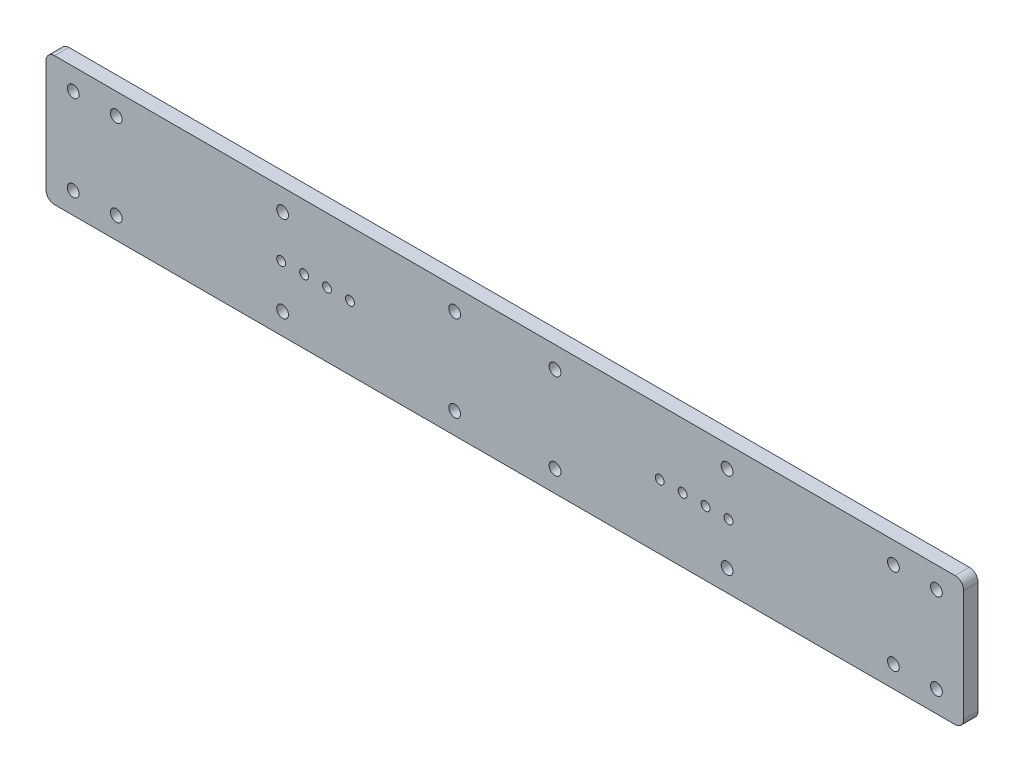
ISO-10303-21;
HEADER;
FILE_DESCRIPTION(('STEP AP214'),'2;1');
FILE_NAME('part.step','',(''),(''),'','','');
FILE_SCHEMA(('AUTOMOTIVE_DESIGN { 1 0 10303 214 1 1 1 1 }'));
ENDSEC;
DATA;
#1=APPLICATION_CONTEXT('core data for automotive mechanical design processes');
#2=APPLICATION_PROTOCOL_DEFINITION('international standard','automotive_design',2000,#1);
#3=PRODUCT_CONTEXT('',#1,'mechanical');
#4=PRODUCT('Part','Part','',(#3));
#5=PRODUCT_RELATED_PRODUCT_CATEGORY('part','',(#4));
#6=PRODUCT_DEFINITION_FORMATION('','',#4);
#7=PRODUCT_DEFINITION_CONTEXT('part definition',#1,'design');
#8=PRODUCT_DEFINITION('design','',#6,#7);
#9=PRODUCT_DEFINITION_SHAPE('','',#8);
#10=(LENGTH_UNIT() NAMED_UNIT(*) SI_UNIT(.MILLI.,.METRE.));
#11=(NAMED_UNIT(*) PLANE_ANGLE_UNIT() SI_UNIT($,.RADIAN.));
#12=(NAMED_UNIT(*) SI_UNIT($,.STERADIAN.) SOLID_ANGLE_UNIT());
#13=UNCERTAINTY_MEASURE_WITH_UNIT(LENGTH_MEASURE(1.E-05),#10,'distance_accuracy_value','');
#14=(GEOMETRIC_REPRESENTATION_CONTEXT(3) GLOBAL_UNCERTAINTY_ASSIGNED_CONTEXT((#13)) GLOBAL_UNIT_ASSIGNED_CONTEXT((#10,
#11,#12)) REPRESENTATION_CONTEXT('',''));
#15=CARTESIAN_POINT('',(0.,0.,0.));
#16=DIRECTION('',(0.,0.,1.));
#17=DIRECTION('',(1.,0.,0.));
#18=AXIS2_PLACEMENT_3D('',#15,#16,#17);
#19=CARTESIAN_POINT('',(0.,0.,5.));
#20=DIRECTION('',(0.,0.,-1.));
#21=DIRECTION('',(-1.,0.,0.));
#22=AXIS2_PLACEMENT_3D('',#19,#20,#21);
#23=PLANE('',#22);
#24=CARTESIAN_POINT('',(-54.,-1.20299930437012E-13,5.));
#25=DIRECTION('',(0.,0.,1.));
#26=DIRECTION('',(1.,0.,0.));
#27=AXIS2_PLACEMENT_3D('',#24,#25,#26);
#28=CIRCLE('',#27,1.54999999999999);
#29=CARTESIAN_POINT('',(-52.45,-1.20299930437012E-13,5.));
#30=VERTEX_POINT('',#29);
#31=EDGE_CURVE('E310',#30,#30,#28,.T.);
#32=ORIENTED_EDGE('',*,*,#31,.F.);
#33=EDGE_LOOP('',(#32));
#34=FACE_BOUND('',#33,.T.);
#35=CARTESIAN_POINT('',(54.,-1.20299930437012E-13,5.));
#36=DIRECTION('',(0.,0.,1.));
#37=DIRECTION('',(-1.,0.,0.));
#38=AXIS2_PLACEMENT_3D('',#35,#36,#37);
#39=CIRCLE('',#38,1.54999999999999);
#40=CARTESIAN_POINT('',(52.45,-1.20299930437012E-13,5.));
#41=VERTEX_POINT('',#40);
#42=EDGE_CURVE('E315',#41,#41,#39,.T.);
#43=ORIENTED_EDGE('',*,*,#42,.F.);
#44=EDGE_LOOP('',(#43));
#45=FACE_BOUND('',#44,.T.);
#46=CARTESIAN_POINT('',(62.,-1.2127964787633E-13,5.));
#47=DIRECTION('',(0.,0.,1.));
#48=DIRECTION('',(-1.,0.,0.));
#49=AXIS2_PLACEMENT_3D('',#46,#47,#48);
#50=CIRCLE('',#49,1.54999999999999);
#51=CARTESIAN_POINT('',(60.45,-1.2127964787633E-13,5.));
#52=VERTEX_POINT('',#51);
#53=EDGE_CURVE('E318',#52,#52,#50,.T.);
#54=ORIENTED_EDGE('',*,*,#53,.F.);
#55=EDGE_LOOP('',(#54));
#56=FACE_BOUND('',#55,.T.);
#57=CARTESIAN_POINT('',(-62.,-1.2127964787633E-13,5.));
#58=DIRECTION('',(0.,0.,1.));
#59=DIRECTION('',(1.,0.,0.));
#60=AXIS2_PLACEMENT_3D('',#57,#58,#59);
#61=CIRCLE('',#60,1.54999999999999);
#62=CARTESIAN_POINT('',(-60.45,-1.2127964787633E-13,5.));
#63=VERTEX_POINT('',#62);
#64=EDGE_CURVE('E321',#63,#63,#61,.T.);
#65=ORIENTED_EDGE('',*,*,#64,.F.);
#66=EDGE_LOOP('',(#65));
#67=FACE_BOUND('',#66,.T.);
#68=CARTESIAN_POINT('',(78.,0.,5.));
#69=DIRECTION('',(0.,0.,1.));
#70=DIRECTION('',(-1.,0.,0.));
#71=AXIS2_PLACEMENT_3D('',#68,#69,#70);
#72=CIRCLE('',#71,1.54999999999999);
#73=CARTESIAN_POINT('',(76.45,0.,5.));
#74=VERTEX_POINT('',#73);
#75=EDGE_CURVE('E306',#74,#74,#72,.T.);
#76=ORIENTED_EDGE('',*,*,#75,.F.);
#77=EDGE_LOOP('',(#76));
#78=FACE_BOUND('',#77,.T.);
#79=CARTESIAN_POINT('',(70.,0.,5.));
#80=DIRECTION('',(0.,0.,1.));
#81=DIRECTION('',(-1.,0.,0.));
#82=AXIS2_PLACEMENT_3D('',#79,#80,#81);
#83=CIRCLE('',#82,1.54999999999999);
#84=CARTESIAN_POINT('',(68.45,0.,5.));
#85=VERTEX_POINT('',#84);
#86=EDGE_CURVE('E309',#85,#85,#83,.T.);
#87=ORIENTED_EDGE('',*,*,#86,.F.);
#88=EDGE_LOOP('',(#87));
#89=FACE_BOUND('',#88,.T.);
#90=CARTESIAN_POINT('',(-78.,0.,5.));
#91=DIRECTION('',(0.,0.,1.));
#92=DIRECTION('',(1.,0.,0.));
#93=AXIS2_PLACEMENT_3D('',#90,#91,#92);
#94=CIRCLE('',#93,1.54999999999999);
#95=CARTESIAN_POINT('',(-76.45,0.,5.));
#96=VERTEX_POINT('',#95);
#97=EDGE_CURVE('E150',#96,#96,#94,.T.);
#98=ORIENTED_EDGE('',*,*,#97,.F.);
#99=EDGE_LOOP('',(#98));
#100=FACE_BOUND('',#99,.T.);
#101=CARTESIAN_POINT('',(-70.,0.,5.));
#102=DIRECTION('',(0.,0.,1.));
#103=DIRECTION('',(1.,0.,0.));
#104=AXIS2_PLACEMENT_3D('',#101,#102,#103);
#105=CIRCLE('',#104,1.54999999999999);
#106=CARTESIAN_POINT('',(-68.45,0.,5.));
#107=VERTEX_POINT('',#106);
#108=EDGE_CURVE('E145',#107,#107,#105,.T.);
#109=ORIENTED_EDGE('',*,*,#108,.F.);
#110=EDGE_LOOP('',(#109));
#111=FACE_BOUND('',#110,.T.);
#112=DIRECTION('',(0.,1.,0.));
#113=VECTOR('',#112,1.);
#114=CARTESIAN_POINT('',(160.,-22.5,5.));
#115=LINE('',#114,#113);
#116=CARTESIAN_POINT('',(160.,-19.5,5.));
#117=VERTEX_POINT('',#116);
#118=CARTESIAN_POINT('',(160.,19.5,5.));
#119=VERTEX_POINT('',#118);
#120=EDGE_CURVE('E140',#117,#119,#115,.T.);
#121=ORIENTED_EDGE('',*,*,#120,.T.);
#122=CARTESIAN_POINT('',(157.,19.5,5.));
#123=DIRECTION('',(0.,0.,-1.));
#124=DIRECTION('',(-1.,0.,0.));
#125=AXIS2_PLACEMENT_3D('',#122,#123,#124);
#126=CIRCLE('',#125,3.);
#127=CARTESIAN_POINT('',(157.,22.5,5.));
#128=VERTEX_POINT('',#127);
#129=EDGE_CURVE('E181',#119,#128,#126,.F.);
#130=ORIENTED_EDGE('',*,*,#129,.T.);
#131=DIRECTION('',(-1.,0.,0.));
#132=VECTOR('',#131,1.);
#133=CARTESIAN_POINT('',(-160.,22.5,5.));
#134=LINE('',#133,#132);
#135=CARTESIAN_POINT('',(-157.,22.5,5.));
#136=VERTEX_POINT('',#135);
#137=EDGE_CURVE('E121',#128,#136,#134,.T.);
#138=ORIENTED_EDGE('',*,*,#137,.T.);
#139=CARTESIAN_POINT('',(-157.,19.5,5.));
#140=DIRECTION('',(0.,0.,-1.));
#141=DIRECTION('',(-1.,0.,0.));
#142=AXIS2_PLACEMENT_3D('',#139,#140,#141);
#143=CIRCLE('',#142,3.);
#144=CARTESIAN_POINT('',(-160.,19.5,5.));
#145=VERTEX_POINT('',#144);
#146=EDGE_CURVE('E177',#136,#145,#143,.F.);
#147=ORIENTED_EDGE('',*,*,#146,.T.);
#148=DIRECTION('',(0.,-1.,0.));
#149=VECTOR('',#148,1.);
#150=CARTESIAN_POINT('',(-160.,-22.5,5.));
#151=LINE('',#150,#149);
#152=CARTESIAN_POINT('',(-160.,-19.5,5.));
#153=VERTEX_POINT('',#152);
#154=EDGE_CURVE('E190',#145,#153,#151,.T.);
#155=ORIENTED_EDGE('',*,*,#154,.T.);
#156=CARTESIAN_POINT('',(-157.,-19.5,5.));
#157=DIRECTION('',(0.,0.,-1.));
#158=DIRECTION('',(-1.,0.,0.));
#159=AXIS2_PLACEMENT_3D('',#156,#157,#158);
#160=CIRCLE('',#159,3.);
#161=CARTESIAN_POINT('',(-157.,-22.5,5.));
#162=VERTEX_POINT('',#161);
#163=EDGE_CURVE('E56',#153,#162,#160,.F.);
#164=ORIENTED_EDGE('',*,*,#163,.T.);
#165=DIRECTION('',(1.,0.,0.));
#166=VECTOR('',#165,1.);
#167=CARTESIAN_POINT('',(-160.,-22.5,5.));
#168=LINE('',#167,#166);
#169=CARTESIAN_POINT('',(157.,-22.5,5.));
#170=VERTEX_POINT('',#169);
#171=EDGE_CURVE('E168',#162,#170,#168,.T.);
#172=ORIENTED_EDGE('',*,*,#171,.T.);
#173=CARTESIAN_POINT('',(157.,-19.5,5.));
#174=DIRECTION('',(0.,0.,-1.));
#175=DIRECTION('',(-1.,0.,0.));
#176=AXIS2_PLACEMENT_3D('',#173,#174,#175);
#177=CIRCLE('',#176,3.);
#178=EDGE_CURVE('E179',#170,#117,#177,.F.);
#179=ORIENTED_EDGE('',*,*,#178,.T.);
#180=EDGE_LOOP('',(#121,#130,#138,#147,#155,#164,#172,#179));
#181=FACE_BOUND('',#180,.T.);
#182=CARTESIAN_POINT('',(-17.5,15.,5.));
#183=DIRECTION('',(0.,0.,1.));
#184=DIRECTION('',(1.,0.,0.));
#185=AXIS2_PLACEMENT_3D('',#182,#183,#184);
#186=CIRCLE('',#185,2.04999999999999);
#187=CARTESIAN_POINT('',(-15.45,15.,5.));
#188=VERTEX_POINT('',#187);
#189=EDGE_CURVE('E135',#188,#188,#186,.T.);
#190=ORIENTED_EDGE('',*,*,#189,.F.);
#191=EDGE_LOOP('',(#190));
#192=FACE_BOUND('',#191,.T.);
#193=CARTESIAN_POINT('',(-150.5,15.,5.));
#194=DIRECTION('',(0.,0.,1.));
#195=DIRECTION('',(1.,0.,0.));
#196=AXIS2_PLACEMENT_3D('',#193,#194,#195);
#197=CIRCLE('',#196,2.04999999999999);
#198=CARTESIAN_POINT('',(-148.45,15.,5.));
#199=VERTEX_POINT('',#198);
#200=EDGE_CURVE('E213',#199,#199,#197,.T.);
#201=ORIENTED_EDGE('',*,*,#200,.F.);
#202=EDGE_LOOP('',(#201));
#203=FACE_BOUND('',#202,.T.);
#204=CARTESIAN_POINT('',(17.5,15.,5.));
#205=DIRECTION('',(0.,0.,1.));
#206=DIRECTION('',(1.,0.,0.));
#207=AXIS2_PLACEMENT_3D('',#204,#205,#206);
#208=CIRCLE('',#207,2.04999999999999);
#209=CARTESIAN_POINT('',(19.55,15.,5.));
#210=VERTEX_POINT('',#209);
#211=EDGE_CURVE('E219',#210,#210,#208,.T.);
#212=ORIENTED_EDGE('',*,*,#211,.F.);
#213=EDGE_LOOP('',(#212));
#214=FACE_BOUND('',#213,.T.);
#215=CARTESIAN_POINT('',(17.5000000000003,-15.,5.));
#216=DIRECTION('',(0.,0.,1.));
#217=DIRECTION('',(1.,0.,0.));
#218=AXIS2_PLACEMENT_3D('',#215,#216,#217);
#219=CIRCLE('',#218,2.04999999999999);
#220=CARTESIAN_POINT('',(19.5500000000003,-15.,5.));
#221=VERTEX_POINT('',#220);
#222=EDGE_CURVE('E225',#221,#221,#219,.T.);
#223=ORIENTED_EDGE('',*,*,#222,.F.);
#224=EDGE_LOOP('',(#223));
#225=FACE_BOUND('',#224,.T.);
#226=CARTESIAN_POINT('',(-17.4999999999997,-15.,5.));
#227=DIRECTION('',(0.,0.,1.));
#228=DIRECTION('',(1.,0.,0.));
#229=AXIS2_PLACEMENT_3D('',#226,#227,#228);
#230=CIRCLE('',#229,2.04999999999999);
#231=CARTESIAN_POINT('',(-15.4499999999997,-15.,5.));
#232=VERTEX_POINT('',#231);
#233=EDGE_CURVE('E231',#232,#232,#230,.T.);
#234=ORIENTED_EDGE('',*,*,#233,.F.);
#235=EDGE_LOOP('',(#234));
#236=FACE_BOUND('',#235,.T.);
#237=CARTESIAN_POINT('',(150.5,15.,5.));
#238=DIRECTION('',(0.,0.,1.));
#239=DIRECTION('',(-1.,0.,0.));
#240=AXIS2_PLACEMENT_3D('',#237,#238,#239);
#241=CIRCLE('',#240,2.04999999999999);
#242=CARTESIAN_POINT('',(148.45,15.,5.));
#243=VERTEX_POINT('',#242);
#244=EDGE_CURVE('E237',#243,#243,#241,.T.);
#245=ORIENTED_EDGE('',*,*,#244,.F.);
#246=EDGE_LOOP('',(#245));
#247=FACE_BOUND('',#246,.T.);
#248=CARTESIAN_POINT('',(-135.5,15.,5.));
#249=DIRECTION('',(0.,0.,1.));
#250=DIRECTION('',(1.,0.,0.));
#251=AXIS2_PLACEMENT_3D('',#248,#249,#250);
#252=CIRCLE('',#251,2.04999999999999);
#253=CARTESIAN_POINT('',(-133.45,15.,5.));
#254=VERTEX_POINT('',#253);
#255=EDGE_CURVE('E243',#254,#254,#252,.T.);
#256=ORIENTED_EDGE('',*,*,#255,.F.);
#257=EDGE_LOOP('',(#256));
#258=FACE_BOUND('',#257,.T.);
#259=CARTESIAN_POINT('',(-135.5,-15.,5.));
#260=DIRECTION('',(0.,0.,1.));
#261=DIRECTION('',(1.,0.,0.));
#262=AXIS2_PLACEMENT_3D('',#259,#260,#261);
#263=CIRCLE('',#262,2.04999999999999);
#264=CARTESIAN_POINT('',(-133.45,-15.,5.));
#265=VERTEX_POINT('',#264);
#266=EDGE_CURVE('E249',#265,#265,#263,.T.);
#267=ORIENTED_EDGE('',*,*,#266,.F.);
#268=EDGE_LOOP('',(#267));
#269=FACE_BOUND('',#268,.T.);
#270=CARTESIAN_POINT('',(-150.5,-15.,5.));
#271=DIRECTION('',(0.,0.,1.));
#272=DIRECTION('',(1.,0.,0.));
#273=AXIS2_PLACEMENT_3D('',#270,#271,#272);
#274=CIRCLE('',#273,2.04999999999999);
#275=CARTESIAN_POINT('',(-148.45,-15.,5.));
#276=VERTEX_POINT('',#275);
#277=EDGE_CURVE('E255',#276,#276,#274,.T.);
#278=ORIENTED_EDGE('',*,*,#277,.F.);
#279=EDGE_LOOP('',(#278));
#280=FACE_BOUND('',#279,.T.);
#281=CARTESIAN_POINT('',(150.5,-15.,5.));
#282=DIRECTION('',(0.,0.,1.));
#283=DIRECTION('',(-1.,0.,0.));
#284=AXIS2_PLACEMENT_3D('',#281,#282,#283);
#285=CIRCLE('',#284,2.04999999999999);
#286=CARTESIAN_POINT('',(148.45,-15.,5.));
#287=VERTEX_POINT('',#286);
#288=EDGE_CURVE('E261',#287,#287,#285,.T.);
#289=ORIENTED_EDGE('',*,*,#288,.F.);
#290=EDGE_LOOP('',(#289));
#291=FACE_BOUND('',#290,.T.);
#292=CARTESIAN_POINT('',(135.5,-15.,5.));
#293=DIRECTION('',(0.,0.,1.));
#294=DIRECTION('',(-1.,0.,0.));
#295=AXIS2_PLACEMENT_3D('',#292,#293,#294);
#296=CIRCLE('',#295,2.04999999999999);
#297=CARTESIAN_POINT('',(133.45,-15.,5.));
#298=VERTEX_POINT('',#297);
#299=EDGE_CURVE('E267',#298,#298,#296,.T.);
#300=ORIENTED_EDGE('',*,*,#299,.F.);
#301=EDGE_LOOP('',(#300));
#302=FACE_BOUND('',#301,.T.);
#303=CARTESIAN_POINT('',(135.5,15.,5.));
#304=DIRECTION('',(0.,0.,1.));
#305=DIRECTION('',(-1.,0.,0.));
#306=AXIS2_PLACEMENT_3D('',#303,#304,#305);
#307=CIRCLE('',#306,2.04999999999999);
#308=CARTESIAN_POINT('',(133.45,15.,5.));
#309=VERTEX_POINT('',#308);
#310=EDGE_CURVE('E273',#309,#309,#307,.T.);
#311=ORIENTED_EDGE('',*,*,#310,.F.);
#312=EDGE_LOOP('',(#311));
#313=FACE_BOUND('',#312,.T.);
#314=CARTESIAN_POINT('',(-77.5,14.9999999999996,5.));
#315=DIRECTION('',(0.,0.,1.));
#316=DIRECTION('',(1.,0.,0.));
#317=AXIS2_PLACEMENT_3D('',#314,#315,#316);
#318=CIRCLE('',#317,2.04999999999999);
#319=CARTESIAN_POINT('',(-75.45,14.9999999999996,5.));
#320=VERTEX_POINT('',#319);
#321=EDGE_CURVE('E279',#320,#320,#318,.T.);
#322=ORIENTED_EDGE('',*,*,#321,.F.);
#323=EDGE_LOOP('',(#322));
#324=FACE_BOUND('',#323,.T.);
#325=CARTESIAN_POINT('',(-77.4999999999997,-15.0000000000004,5.));
#326=DIRECTION('',(0.,0.,1.));
#327=DIRECTION('',(1.,0.,0.));
#328=AXIS2_PLACEMENT_3D('',#325,#326,#327);
#329=CIRCLE('',#328,2.04999999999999);
#330=CARTESIAN_POINT('',(-75.4499999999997,-15.0000000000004,5.));
#331=VERTEX_POINT('',#330);
#332=EDGE_CURVE('E285',#331,#331,#329,.T.);
#333=ORIENTED_EDGE('',*,*,#332,.F.);
#334=EDGE_LOOP('',(#333));
#335=FACE_BOUND('',#334,.T.);
#336=CARTESIAN_POINT('',(77.4999999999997,-15.0000000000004,5.));
#337=DIRECTION('',(0.,0.,1.));
#338=DIRECTION('',(-1.,0.,0.));
#339=AXIS2_PLACEMENT_3D('',#336,#337,#338);
#340=CIRCLE('',#339,2.04999999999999);
#341=CARTESIAN_POINT('',(75.4499999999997,-15.0000000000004,5.));
#342=VERTEX_POINT('',#341);
#343=EDGE_CURVE('E291',#342,#342,#340,.T.);
#344=ORIENTED_EDGE('',*,*,#343,.F.);
#345=EDGE_LOOP('',(#344));
#346=FACE_BOUND('',#345,.T.);
#347=CARTESIAN_POINT('',(77.5,14.9999999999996,5.));
#348=DIRECTION('',(0.,0.,1.));
#349=DIRECTION('',(-1.,0.,0.));
#350=AXIS2_PLACEMENT_3D('',#347,#348,#349);
#351=CIRCLE('',#350,2.04999999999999);
#352=CARTESIAN_POINT('',(75.45,14.9999999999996,5.));
#353=VERTEX_POINT('',#352);
#354=EDGE_CURVE('E297',#353,#353,#351,.T.);
#355=ORIENTED_EDGE('',*,*,#354,.F.);
#356=EDGE_LOOP('',(#355));
#357=FACE_BOUND('',#356,.T.);
#358=ADVANCED_FACE('F34',(#34,#45,#56,#67,#78,#89,#100,#111,#181,#192,#203,#214,#225,#236,#247,
#258,#269,#280,#291,#302,#313,#324,#335,#346,#357),#23,.F.);
#359=CARTESIAN_POINT('',(0.,0.,0.));
#360=DIRECTION('',(0.,0.,-1.));
#361=DIRECTION('',(-1.,0.,0.));
#362=AXIS2_PLACEMENT_3D('',#359,#360,#361);
#363=PLANE('',#362);
#364=CARTESIAN_POINT('',(-54.,-1.20299930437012E-13,0.));
#365=DIRECTION('',(0.,0.,-1.));
#366=DIRECTION('',(-1.,0.,0.));
#367=AXIS2_PLACEMENT_3D('',#364,#365,#366);
#368=CIRCLE('',#367,1.54999999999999);
#369=CARTESIAN_POINT('',(-55.55,-1.20299930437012E-13,0.));
#370=VERTEX_POINT('',#369);
#371=EDGE_CURVE('E165',#370,#370,#368,.T.);
#372=ORIENTED_EDGE('',*,*,#371,.F.);
#373=EDGE_LOOP('',(#372));
#374=FACE_BOUND('',#373,.T.);
#375=CARTESIAN_POINT('',(54.,-1.20299930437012E-13,0.));
#376=DIRECTION('',(0.,0.,-1.));
#377=DIRECTION('',(-1.,0.,0.));
#378=AXIS2_PLACEMENT_3D('',#375,#376,#377);
#379=CIRCLE('',#378,1.54999999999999);
#380=CARTESIAN_POINT('',(52.45,-1.20299930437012E-13,0.));
#381=VERTEX_POINT('',#380);
#382=EDGE_CURVE('E162',#381,#381,#379,.T.);
#383=ORIENTED_EDGE('',*,*,#382,.F.);
#384=EDGE_LOOP('',(#383));
#385=FACE_BOUND('',#384,.T.);
#386=CARTESIAN_POINT('',(62.,-1.2127964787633E-13,0.));
#387=DIRECTION('',(0.,0.,-1.));
#388=DIRECTION('',(-1.,0.,0.));
#389=AXIS2_PLACEMENT_3D('',#386,#387,#388);
#390=CIRCLE('',#389,1.54999999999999);
#391=CARTESIAN_POINT('',(60.45,-1.2127964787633E-13,0.));
#392=VERTEX_POINT('',#391);
#393=EDGE_CURVE('E159',#392,#392,#390,.T.);
#394=ORIENTED_EDGE('',*,*,#393,.F.);
#395=EDGE_LOOP('',(#394));
#396=FACE_BOUND('',#395,.T.);
#397=CARTESIAN_POINT('',(-62.,-1.2127964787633E-13,0.));
#398=DIRECTION('',(0.,0.,-1.));
#399=DIRECTION('',(-1.,0.,0.));
#400=AXIS2_PLACEMENT_3D('',#397,#398,#399);
#401=CIRCLE('',#400,1.54999999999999);
#402=CARTESIAN_POINT('',(-63.55,-1.2127964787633E-13,0.));
#403=VERTEX_POINT('',#402);
#404=EDGE_CURVE('E156',#403,#403,#401,.T.);
#405=ORIENTED_EDGE('',*,*,#404,.F.);
#406=EDGE_LOOP('',(#405));
#407=FACE_BOUND('',#406,.T.);
#408=CARTESIAN_POINT('',(78.,0.,0.));
#409=DIRECTION('',(0.,0.,-1.));
#410=DIRECTION('',(-1.,0.,0.));
#411=AXIS2_PLACEMENT_3D('',#408,#409,#410);
#412=CIRCLE('',#411,1.54999999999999);
#413=CARTESIAN_POINT('',(76.45,0.,0.));
#414=VERTEX_POINT('',#413);
#415=EDGE_CURVE('E153',#414,#414,#412,.T.);
#416=ORIENTED_EDGE('',*,*,#415,.F.);
#417=EDGE_LOOP('',(#416));
#418=FACE_BOUND('',#417,.T.);
#419=CARTESIAN_POINT('',(70.,0.,0.));
#420=DIRECTION('',(0.,0.,-1.));
#421=DIRECTION('',(-1.,0.,0.));
#422=AXIS2_PLACEMENT_3D('',#419,#420,#421);
#423=CIRCLE('',#422,1.54999999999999);
#424=CARTESIAN_POINT('',(68.45,0.,0.));
#425=VERTEX_POINT('',#424);
#426=EDGE_CURVE('E149',#425,#425,#423,.T.);
#427=ORIENTED_EDGE('',*,*,#426,.F.);
#428=EDGE_LOOP('',(#427));
#429=FACE_BOUND('',#428,.T.);
#430=CARTESIAN_POINT('',(-78.,0.,0.));
#431=DIRECTION('',(0.,0.,-1.));
#432=DIRECTION('',(-1.,0.,0.));
#433=AXIS2_PLACEMENT_3D('',#430,#431,#432);
#434=CIRCLE('',#433,1.54999999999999);
#435=CARTESIAN_POINT('',(-79.55,0.,0.));
#436=VERTEX_POINT('',#435);
#437=EDGE_CURVE('E146',#436,#436,#434,.T.);
#438=ORIENTED_EDGE('',*,*,#437,.F.);
#439=EDGE_LOOP('',(#438));
#440=FACE_BOUND('',#439,.T.);
#441=CARTESIAN_POINT('',(-70.,0.,0.));
#442=DIRECTION('',(0.,0.,-1.));
#443=DIRECTION('',(-1.,0.,0.));
#444=AXIS2_PLACEMENT_3D('',#441,#442,#443);
#445=CIRCLE('',#444,1.54999999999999);
#446=CARTESIAN_POINT('',(-71.55,0.,0.));
#447=VERTEX_POINT('',#446);
#448=EDGE_CURVE('E141',#447,#447,#445,.T.);
#449=ORIENTED_EDGE('',*,*,#448,.F.);
#450=EDGE_LOOP('',(#449));
#451=FACE_BOUND('',#450,.T.);
#452=CARTESIAN_POINT('',(77.4999999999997,-15.0000000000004,0.));
#453=DIRECTION('',(0.,0.,1.));
#454=DIRECTION('',(-1.,0.,0.));
#455=AXIS2_PLACEMENT_3D('',#452,#453,#454);
#456=CIRCLE('',#455,2.04999999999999);
#457=CARTESIAN_POINT('',(75.4499999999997,-15.0000000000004,0.));
#458=VERTEX_POINT('',#457);
#459=EDGE_CURVE('E294',#458,#458,#456,.T.);
#460=ORIENTED_EDGE('',*,*,#459,.T.);
#461=EDGE_LOOP('',(#460));
#462=FACE_BOUND('',#461,.T.);
#463=CARTESIAN_POINT('',(-77.5,14.9999999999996,0.));
#464=DIRECTION('',(0.,0.,1.));
#465=DIRECTION('',(1.,0.,0.));
#466=AXIS2_PLACEMENT_3D('',#463,#464,#465);
#467=CIRCLE('',#466,2.04999999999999);
#468=CARTESIAN_POINT('',(-75.45,14.9999999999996,0.));
#469=VERTEX_POINT('',#468);
#470=EDGE_CURVE('E282',#469,#469,#467,.T.);
#471=ORIENTED_EDGE('',*,*,#470,.T.);
#472=EDGE_LOOP('',(#471));
#473=FACE_BOUND('',#472,.T.);
#474=CARTESIAN_POINT('',(135.5,-15.,0.));
#475=DIRECTION('',(0.,0.,1.));
#476=DIRECTION('',(-1.,0.,0.));
#477=AXIS2_PLACEMENT_3D('',#474,#475,#476);
#478=CIRCLE('',#477,2.04999999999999);
#479=CARTESIAN_POINT('',(133.45,-15.,0.));
#480=VERTEX_POINT('',#479);
#481=EDGE_CURVE('E270',#480,#480,#478,.T.);
#482=ORIENTED_EDGE('',*,*,#481,.T.);
#483=EDGE_LOOP('',(#482));
#484=FACE_BOUND('',#483,.T.);
#485=CARTESIAN_POINT('',(-150.5,-15.,0.));
#486=DIRECTION('',(0.,0.,1.));
#487=DIRECTION('',(1.,0.,0.));
#488=AXIS2_PLACEMENT_3D('',#485,#486,#487);
#489=CIRCLE('',#488,2.04999999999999);
#490=CARTESIAN_POINT('',(-148.45,-15.,0.));
#491=VERTEX_POINT('',#490);
#492=EDGE_CURVE('E258',#491,#491,#489,.T.);
#493=ORIENTED_EDGE('',*,*,#492,.T.);
#494=EDGE_LOOP('',(#493));
#495=FACE_BOUND('',#494,.T.);
#496=CARTESIAN_POINT('',(-135.5,15.,0.));
#497=DIRECTION('',(0.,0.,1.));
#498=DIRECTION('',(1.,0.,0.));
#499=AXIS2_PLACEMENT_3D('',#496,#497,#498);
#500=CIRCLE('',#499,2.04999999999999);
#501=CARTESIAN_POINT('',(-133.45,15.,0.));
#502=VERTEX_POINT('',#501);
#503=EDGE_CURVE('E246',#502,#502,#500,.T.);
#504=ORIENTED_EDGE('',*,*,#503,.T.);
#505=EDGE_LOOP('',(#504));
#506=FACE_BOUND('',#505,.T.);
#507=CARTESIAN_POINT('',(-17.4999999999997,-15.,0.));
#508=DIRECTION('',(0.,0.,1.));
#509=DIRECTION('',(1.,0.,0.));
#510=AXIS2_PLACEMENT_3D('',#507,#508,#509);
#511=CIRCLE('',#510,2.04999999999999);
#512=CARTESIAN_POINT('',(-15.4499999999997,-15.,0.));
#513=VERTEX_POINT('',#512);
#514=EDGE_CURVE('E234',#513,#513,#511,.T.);
#515=ORIENTED_EDGE('',*,*,#514,.T.);
#516=EDGE_LOOP('',(#515));
#517=FACE_BOUND('',#516,.T.);
#518=CARTESIAN_POINT('',(17.5,15.,0.));
#519=DIRECTION('',(0.,0.,1.));
#520=DIRECTION('',(1.,0.,0.));
#521=AXIS2_PLACEMENT_3D('',#518,#519,#520);
#522=CIRCLE('',#521,2.04999999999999);
#523=CARTESIAN_POINT('',(19.55,15.,0.));
#524=VERTEX_POINT('',#523);
#525=EDGE_CURVE('E222',#524,#524,#522,.T.);
#526=ORIENTED_EDGE('',*,*,#525,.T.);
#527=EDGE_LOOP('',(#526));
#528=FACE_BOUND('',#527,.T.);
#529=CARTESIAN_POINT('',(-17.5,15.,0.));
#530=DIRECTION('',(0.,0.,1.));
#531=DIRECTION('',(1.,0.,0.));
#532=AXIS2_PLACEMENT_3D('',#529,#530,#531);
#533=CIRCLE('',#532,2.04999999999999);
#534=CARTESIAN_POINT('',(-15.45,15.,0.));
#535=VERTEX_POINT('',#534);
#536=EDGE_CURVE('E210',#535,#535,#533,.T.);
#537=ORIENTED_EDGE('',*,*,#536,.T.);
#538=EDGE_LOOP('',(#537));
#539=FACE_BOUND('',#538,.T.);
#540=DIRECTION('',(-1.,0.,0.));
#541=VECTOR('',#540,1.);
#542=CARTESIAN_POINT('',(-160.,22.5,0.));
#543=LINE('',#542,#541);
#544=CARTESIAN_POINT('',(157.,22.5,0.));
#545=VERTEX_POINT('',#544);
#546=CARTESIAN_POINT('',(-157.,22.5,0.));
#547=VERTEX_POINT('',#546);
#548=EDGE_CURVE('E118',#545,#547,#543,.T.);
#549=ORIENTED_EDGE('',*,*,#548,.F.);
#550=CARTESIAN_POINT('',(157.,19.5,0.));
#551=DIRECTION('',(0.,0.,-1.));
#552=DIRECTION('',(-1.,0.,0.));
#553=AXIS2_PLACEMENT_3D('',#550,#551,#552);
#554=CIRCLE('',#553,3.);
#555=CARTESIAN_POINT('',(160.,19.5,0.));
#556=VERTEX_POINT('',#555);
#557=EDGE_CURVE('E101',#545,#556,#554,.T.);
#558=ORIENTED_EDGE('',*,*,#557,.T.);
#559=DIRECTION('',(0.,1.,0.));
#560=VECTOR('',#559,1.);
#561=CARTESIAN_POINT('',(160.,-22.5,0.));
#562=LINE('',#561,#560);
#563=CARTESIAN_POINT('',(160.,-19.5,0.));
#564=VERTEX_POINT('',#563);
#565=EDGE_CURVE('E130',#564,#556,#562,.T.);
#566=ORIENTED_EDGE('',*,*,#565,.F.);
#567=CARTESIAN_POINT('',(157.,-19.5,0.));
#568=DIRECTION('',(0.,0.,-1.));
#569=DIRECTION('',(-1.,0.,0.));
#570=AXIS2_PLACEMENT_3D('',#567,#568,#569);
#571=CIRCLE('',#570,3.);
#572=CARTESIAN_POINT('',(157.,-22.5,0.));
#573=VERTEX_POINT('',#572);
#574=EDGE_CURVE('E112',#564,#573,#571,.T.);
#575=ORIENTED_EDGE('',*,*,#574,.T.);
#576=DIRECTION('',(1.,0.,0.));
#577=VECTOR('',#576,1.);
#578=CARTESIAN_POINT('',(-160.,-22.5,0.));
#579=LINE('',#578,#577);
#580=CARTESIAN_POINT('',(-157.,-22.5,0.));
#581=VERTEX_POINT('',#580);
#582=EDGE_CURVE('E133',#581,#573,#579,.T.);
#583=ORIENTED_EDGE('',*,*,#582,.F.);
#584=CARTESIAN_POINT('',(-157.,-19.5,0.));
#585=DIRECTION('',(0.,0.,-1.));
#586=DIRECTION('',(-1.,0.,0.));
#587=AXIS2_PLACEMENT_3D('',#584,#585,#586);
#588=CIRCLE('',#587,3.);
#589=CARTESIAN_POINT('',(-160.,-19.5,0.));
#590=VERTEX_POINT('',#589);
#591=EDGE_CURVE('E122',#581,#590,#588,.T.);
#592=ORIENTED_EDGE('',*,*,#591,.T.);
#593=DIRECTION('',(0.,-1.,0.));
#594=VECTOR('',#593,1.);
#595=CARTESIAN_POINT('',(-160.,-22.5,0.));
#596=LINE('',#595,#594);
#597=CARTESIAN_POINT('',(-160.,19.5,0.));
#598=VERTEX_POINT('',#597);
#599=EDGE_CURVE('E129',#598,#590,#596,.T.);
#600=ORIENTED_EDGE('',*,*,#599,.F.);
#601=CARTESIAN_POINT('',(-157.,19.5,0.));
#602=DIRECTION('',(0.,0.,-1.));
#603=DIRECTION('',(-1.,0.,0.));
#604=AXIS2_PLACEMENT_3D('',#601,#602,#603);
#605=CIRCLE('',#604,3.);
#606=EDGE_CURVE('E128',#598,#547,#605,.T.);
#607=ORIENTED_EDGE('',*,*,#606,.T.);
#608=EDGE_LOOP('',(#549,#558,#566,#575,#583,#592,#600,#607));
#609=FACE_BOUND('',#608,.T.);
#610=CARTESIAN_POINT('',(-150.5,15.,0.));
#611=DIRECTION('',(0.,0.,1.));
#612=DIRECTION('',(1.,0.,0.));
#613=AXIS2_PLACEMENT_3D('',#610,#611,#612);
#614=CIRCLE('',#613,2.04999999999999);
#615=CARTESIAN_POINT('',(-148.45,15.,0.));
#616=VERTEX_POINT('',#615);
#617=EDGE_CURVE('E216',#616,#616,#614,.T.);
#618=ORIENTED_EDGE('',*,*,#617,.T.);
#619=EDGE_LOOP('',(#618));
#620=FACE_BOUND('',#619,.T.);
#621=CARTESIAN_POINT('',(17.5000000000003,-15.,0.));
#622=DIRECTION('',(0.,0.,1.));
#623=DIRECTION('',(1.,0.,0.));
#624=AXIS2_PLACEMENT_3D('',#621,#622,#623);
#625=CIRCLE('',#624,2.04999999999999);
#626=CARTESIAN_POINT('',(19.5500000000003,-15.,0.));
#627=VERTEX_POINT('',#626);
#628=EDGE_CURVE('E228',#627,#627,#625,.T.);
#629=ORIENTED_EDGE('',*,*,#628,.T.);
#630=EDGE_LOOP('',(#629));
#631=FACE_BOUND('',#630,.T.);
#632=CARTESIAN_POINT('',(150.5,15.,0.));
#633=DIRECTION('',(0.,0.,1.));
#634=DIRECTION('',(-1.,0.,0.));
#635=AXIS2_PLACEMENT_3D('',#632,#633,#634);
#636=CIRCLE('',#635,2.04999999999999);
#637=CARTESIAN_POINT('',(148.45,15.,0.));
#638=VERTEX_POINT('',#637);
#639=EDGE_CURVE('E240',#638,#638,#636,.T.);
#640=ORIENTED_EDGE('',*,*,#639,.T.);
#641=EDGE_LOOP('',(#640));
#642=FACE_BOUND('',#641,.T.);
#643=CARTESIAN_POINT('',(-135.5,-15.,0.));
#644=DIRECTION('',(0.,0.,1.));
#645=DIRECTION('',(1.,0.,0.));
#646=AXIS2_PLACEMENT_3D('',#643,#644,#645);
#647=CIRCLE('',#646,2.04999999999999);
#648=CARTESIAN_POINT('',(-133.45,-15.,0.));
#649=VERTEX_POINT('',#648);
#650=EDGE_CURVE('E252',#649,#649,#647,.T.);
#651=ORIENTED_EDGE('',*,*,#650,.T.);
#652=EDGE_LOOP('',(#651));
#653=FACE_BOUND('',#652,.T.);
#654=CARTESIAN_POINT('',(150.5,-15.,0.));
#655=DIRECTION('',(0.,0.,1.));
#656=DIRECTION('',(-1.,0.,0.));
#657=AXIS2_PLACEMENT_3D('',#654,#655,#656);
#658=CIRCLE('',#657,2.04999999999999);
#659=CARTESIAN_POINT('',(148.45,-15.,0.));
#660=VERTEX_POINT('',#659);
#661=EDGE_CURVE('E264',#660,#660,#658,.T.);
#662=ORIENTED_EDGE('',*,*,#661,.T.);
#663=EDGE_LOOP('',(#662));
#664=FACE_BOUND('',#663,.T.);
#665=CARTESIAN_POINT('',(135.5,15.,0.));
#666=DIRECTION('',(0.,0.,1.));
#667=DIRECTION('',(-1.,0.,0.));
#668=AXIS2_PLACEMENT_3D('',#665,#666,#667);
#669=CIRCLE('',#668,2.04999999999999);
#670=CARTESIAN_POINT('',(133.45,15.,0.));
#671=VERTEX_POINT('',#670);
#672=EDGE_CURVE('E276',#671,#671,#669,.T.);
#673=ORIENTED_EDGE('',*,*,#672,.T.);
#674=EDGE_LOOP('',(#673));
#675=FACE_BOUND('',#674,.T.);
#676=CARTESIAN_POINT('',(-77.4999999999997,-15.0000000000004,0.));
#677=DIRECTION('',(0.,0.,1.));
#678=DIRECTION('',(1.,0.,0.));
#679=AXIS2_PLACEMENT_3D('',#676,#677,#678);
#680=CIRCLE('',#679,2.04999999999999);
#681=CARTESIAN_POINT('',(-75.4499999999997,-15.0000000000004,0.));
#682=VERTEX_POINT('',#681);
#683=EDGE_CURVE('E288',#682,#682,#680,.T.);
#684=ORIENTED_EDGE('',*,*,#683,.T.);
#685=EDGE_LOOP('',(#684));
#686=FACE_BOUND('',#685,.T.);
#687=CARTESIAN_POINT('',(77.5,14.9999999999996,0.));
#688=DIRECTION('',(0.,0.,1.));
#689=DIRECTION('',(-1.,0.,0.));
#690=AXIS2_PLACEMENT_3D('',#687,#688,#689);
#691=CIRCLE('',#690,2.04999999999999);
#692=CARTESIAN_POINT('',(75.45,14.9999999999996,0.));
#693=VERTEX_POINT('',#692);
#694=EDGE_CURVE('E144',#693,#693,#691,.T.);
#695=ORIENTED_EDGE('',*,*,#694,.T.);
#696=EDGE_LOOP('',(#695));
#697=FACE_BOUND('',#696,.T.);
#698=ADVANCED_FACE('F125',(#374,#385,#396,#407,#418,#429,#440,#451,#462,#473,#484,#495,#506,
#517,#528,#539,#609,#620,#631,#642,#653,#664,#675,#686,#697),#363,.T.);
#699=CARTESIAN_POINT('',(160.,-22.5,5.));
#700=DIRECTION('',(-1.,0.,0.));
#701=DIRECTION('',(0.,0.,1.));
#702=AXIS2_PLACEMENT_3D('',#699,#700,#701);
#703=PLANE('',#702);
#704=ORIENTED_EDGE('',*,*,#565,.T.);
#705=DIRECTION('',(0.,0.,-1.));
#706=VECTOR('',#705,1.);
#707=CARTESIAN_POINT('',(160.,19.5,5.));
#708=LINE('',#707,#706);
#709=EDGE_CURVE('E106',#556,#119,#708,.F.);
#710=ORIENTED_EDGE('',*,*,#709,.T.);
#711=ORIENTED_EDGE('',*,*,#120,.F.);
#712=DIRECTION('',(0.,0.,-1.));
#713=VECTOR('',#712,1.);
#714=CARTESIAN_POINT('',(160.,-19.5,5.));
#715=LINE('',#714,#713);
#716=EDGE_CURVE('E111',#117,#564,#715,.T.);
#717=ORIENTED_EDGE('',*,*,#716,.T.);
#718=EDGE_LOOP('',(#704,#710,#711,#717));
#719=FACE_BOUND('',#718,.T.);
#720=ADVANCED_FACE('F206',(#719),#703,.F.);
#721=CARTESIAN_POINT('',(-160.,22.5,5.));
#722=DIRECTION('',(0.,-1.,0.));
#723=DIRECTION('',(0.,0.,-1.));
#724=AXIS2_PLACEMENT_3D('',#721,#722,#723);
#725=PLANE('',#724);
#726=ORIENTED_EDGE('',*,*,#137,.F.);
#727=DIRECTION('',(0.,0.,-1.));
#728=VECTOR('',#727,1.);
#729=CARTESIAN_POINT('',(157.,22.5,5.));
#730=LINE('',#729,#728);
#731=EDGE_CURVE('E105',#128,#545,#730,.T.);
#732=ORIENTED_EDGE('',*,*,#731,.T.);
#733=ORIENTED_EDGE('',*,*,#548,.T.);
#734=DIRECTION('',(0.,0.,-1.));
#735=VECTOR('',#734,1.);
#736=CARTESIAN_POINT('',(-157.,22.5,5.));
#737=LINE('',#736,#735);
#738=EDGE_CURVE('E123',#547,#136,#737,.F.);
#739=ORIENTED_EDGE('',*,*,#738,.T.);
#740=EDGE_LOOP('',(#726,#732,#733,#739));
#741=FACE_BOUND('',#740,.T.);
#742=ADVANCED_FACE('F117',(#741),#725,.F.);
#743=CARTESIAN_POINT('',(-160.,-22.5,5.));
#744=DIRECTION('',(1.,0.,0.));
#745=DIRECTION('',(0.,0.,-1.));
#746=AXIS2_PLACEMENT_3D('',#743,#744,#745);
#747=PLANE('',#746);
#748=ORIENTED_EDGE('',*,*,#154,.F.);
#749=DIRECTION('',(0.,0.,-1.));
#750=VECTOR('',#749,1.);
#751=CARTESIAN_POINT('',(-160.,19.5,5.));
#752=LINE('',#751,#750);
#753=EDGE_CURVE('E11',#145,#598,#752,.T.);
#754=ORIENTED_EDGE('',*,*,#753,.T.);
#755=ORIENTED_EDGE('',*,*,#599,.T.);
#756=DIRECTION('',(0.,0.,-1.));
#757=VECTOR('',#756,1.);
#758=CARTESIAN_POINT('',(-160.,-19.5,5.));
#759=LINE('',#758,#757);
#760=EDGE_CURVE('E42',#590,#153,#759,.F.);
#761=ORIENTED_EDGE('',*,*,#760,.T.);
#762=EDGE_LOOP('',(#748,#754,#755,#761));
#763=FACE_BOUND('',#762,.T.);
#764=ADVANCED_FACE('F189',(#763),#747,.F.);
#765=CARTESIAN_POINT('',(-160.,-22.5,5.));
#766=DIRECTION('',(0.,1.,0.));
#767=DIRECTION('',(-1.,0.,0.));
#768=AXIS2_PLACEMENT_3D('',#765,#766,#767);
#769=PLANE('',#768);
#770=ORIENTED_EDGE('',*,*,#582,.T.);
#771=DIRECTION('',(0.,0.,-1.));
#772=VECTOR('',#771,1.);
#773=CARTESIAN_POINT('',(157.,-22.5,5.));
#774=LINE('',#773,#772);
#775=EDGE_CURVE('E49',#573,#170,#774,.F.);
#776=ORIENTED_EDGE('',*,*,#775,.T.);
#777=ORIENTED_EDGE('',*,*,#171,.F.);
#778=DIRECTION('',(0.,0.,-1.));
#779=VECTOR('',#778,1.);
#780=CARTESIAN_POINT('',(-157.,-22.5,5.));
#781=LINE('',#780,#779);
#782=EDGE_CURVE('E183',#162,#581,#781,.T.);
#783=ORIENTED_EDGE('',*,*,#782,.T.);
#784=EDGE_LOOP('',(#770,#776,#777,#783));
#785=FACE_BOUND('',#784,.T.);
#786=ADVANCED_FACE('F199',(#785),#769,.F.);
#787=CARTESIAN_POINT('',(-17.5,15.,5.));
#788=DIRECTION('',(0.,0.,-1.));
#789=DIRECTION('',(-1.,0.,0.));
#790=AXIS2_PLACEMENT_3D('',#787,#788,#789);
#791=CYLINDRICAL_SURFACE('',#790,2.04999999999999);
#792=ORIENTED_EDGE('',*,*,#189,.T.);
#793=EDGE_LOOP('',(#792));
#794=FACE_BOUND('',#793,.T.);
#795=ORIENTED_EDGE('',*,*,#536,.F.);
#796=EDGE_LOOP('',(#795));
#797=FACE_BOUND('',#796,.T.);
#798=ADVANCED_FACE('F417',(#794,#797),#791,.F.);
#799=CARTESIAN_POINT('',(-150.5,15.,5.));
#800=DIRECTION('',(0.,0.,-1.));
#801=DIRECTION('',(-1.,0.,0.));
#802=AXIS2_PLACEMENT_3D('',#799,#800,#801);
#803=CYLINDRICAL_SURFACE('',#802,2.04999999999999);
#804=ORIENTED_EDGE('',*,*,#200,.T.);
#805=EDGE_LOOP('',(#804));
#806=FACE_BOUND('',#805,.T.);
#807=ORIENTED_EDGE('',*,*,#617,.F.);
#808=EDGE_LOOP('',(#807));
#809=FACE_BOUND('',#808,.T.);
#810=ADVANCED_FACE('F413',(#806,#809),#803,.F.);
#811=CARTESIAN_POINT('',(17.5,15.,5.));
#812=DIRECTION('',(0.,0.,-1.));
#813=DIRECTION('',(-1.,0.,0.));
#814=AXIS2_PLACEMENT_3D('',#811,#812,#813);
#815=CYLINDRICAL_SURFACE('',#814,2.04999999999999);
#816=ORIENTED_EDGE('',*,*,#211,.T.);
#817=EDGE_LOOP('',(#816));
#818=FACE_BOUND('',#817,.T.);
#819=ORIENTED_EDGE('',*,*,#525,.F.);
#820=EDGE_LOOP('',(#819));
#821=FACE_BOUND('',#820,.T.);
#822=ADVANCED_FACE('F409',(#818,#821),#815,.F.);
#823=CARTESIAN_POINT('',(17.5000000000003,-15.,5.));
#824=DIRECTION('',(0.,0.,-1.));
#825=DIRECTION('',(-1.,0.,0.));
#826=AXIS2_PLACEMENT_3D('',#823,#824,#825);
#827=CYLINDRICAL_SURFACE('',#826,2.04999999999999);
#828=ORIENTED_EDGE('',*,*,#222,.T.);
#829=EDGE_LOOP('',(#828));
#830=FACE_BOUND('',#829,.T.);
#831=ORIENTED_EDGE('',*,*,#628,.F.);
#832=EDGE_LOOP('',(#831));
#833=FACE_BOUND('',#832,.T.);
#834=ADVANCED_FACE('F405',(#830,#833),#827,.F.);
#835=CARTESIAN_POINT('',(-17.4999999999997,-15.,5.));
#836=DIRECTION('',(0.,0.,-1.));
#837=DIRECTION('',(-1.,0.,0.));
#838=AXIS2_PLACEMENT_3D('',#835,#836,#837);
#839=CYLINDRICAL_SURFACE('',#838,2.04999999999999);
#840=ORIENTED_EDGE('',*,*,#233,.T.);
#841=EDGE_LOOP('',(#840));
#842=FACE_BOUND('',#841,.T.);
#843=ORIENTED_EDGE('',*,*,#514,.F.);
#844=EDGE_LOOP('',(#843));
#845=FACE_BOUND('',#844,.T.);
#846=ADVANCED_FACE('F401',(#842,#845),#839,.F.);
#847=CARTESIAN_POINT('',(150.5,15.,5.));
#848=DIRECTION('',(0.,0.,-1.));
#849=DIRECTION('',(-1.,0.,0.));
#850=AXIS2_PLACEMENT_3D('',#847,#848,#849);
#851=CYLINDRICAL_SURFACE('',#850,2.04999999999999);
#852=ORIENTED_EDGE('',*,*,#244,.T.);
#853=EDGE_LOOP('',(#852));
#854=FACE_BOUND('',#853,.T.);
#855=ORIENTED_EDGE('',*,*,#639,.F.);
#856=EDGE_LOOP('',(#855));
#857=FACE_BOUND('',#856,.T.);
#858=ADVANCED_FACE('F397',(#854,#857),#851,.F.);
#859=CARTESIAN_POINT('',(-135.5,15.,5.));
#860=DIRECTION('',(0.,0.,-1.));
#861=DIRECTION('',(-1.,0.,0.));
#862=AXIS2_PLACEMENT_3D('',#859,#860,#861);
#863=CYLINDRICAL_SURFACE('',#862,2.04999999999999);
#864=ORIENTED_EDGE('',*,*,#255,.T.);
#865=EDGE_LOOP('',(#864));
#866=FACE_BOUND('',#865,.T.);
#867=ORIENTED_EDGE('',*,*,#503,.F.);
#868=EDGE_LOOP('',(#867));
#869=FACE_BOUND('',#868,.T.);
#870=ADVANCED_FACE('F393',(#866,#869),#863,.F.);
#871=CARTESIAN_POINT('',(-135.5,-15.,5.));
#872=DIRECTION('',(0.,0.,-1.));
#873=DIRECTION('',(-1.,0.,0.));
#874=AXIS2_PLACEMENT_3D('',#871,#872,#873);
#875=CYLINDRICAL_SURFACE('',#874,2.04999999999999);
#876=ORIENTED_EDGE('',*,*,#266,.T.);
#877=EDGE_LOOP('',(#876));
#878=FACE_BOUND('',#877,.T.);
#879=ORIENTED_EDGE('',*,*,#650,.F.);
#880=EDGE_LOOP('',(#879));
#881=FACE_BOUND('',#880,.T.);
#882=ADVANCED_FACE('F389',(#878,#881),#875,.F.);
#883=CARTESIAN_POINT('',(-150.5,-15.,5.));
#884=DIRECTION('',(0.,0.,-1.));
#885=DIRECTION('',(-1.,0.,0.));
#886=AXIS2_PLACEMENT_3D('',#883,#884,#885);
#887=CYLINDRICAL_SURFACE('',#886,2.04999999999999);
#888=ORIENTED_EDGE('',*,*,#277,.T.);
#889=EDGE_LOOP('',(#888));
#890=FACE_BOUND('',#889,.T.);
#891=ORIENTED_EDGE('',*,*,#492,.F.);
#892=EDGE_LOOP('',(#891));
#893=FACE_BOUND('',#892,.T.);
#894=ADVANCED_FACE('F385',(#890,#893),#887,.F.);
#895=CARTESIAN_POINT('',(150.5,-15.,5.));
#896=DIRECTION('',(0.,0.,-1.));
#897=DIRECTION('',(-1.,0.,0.));
#898=AXIS2_PLACEMENT_3D('',#895,#896,#897);
#899=CYLINDRICAL_SURFACE('',#898,2.04999999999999);
#900=ORIENTED_EDGE('',*,*,#288,.T.);
#901=EDGE_LOOP('',(#900));
#902=FACE_BOUND('',#901,.T.);
#903=ORIENTED_EDGE('',*,*,#661,.F.);
#904=EDGE_LOOP('',(#903));
#905=FACE_BOUND('',#904,.T.);
#906=ADVANCED_FACE('F381',(#902,#905),#899,.F.);
#907=CARTESIAN_POINT('',(135.5,-15.,5.));
#908=DIRECTION('',(0.,0.,-1.));
#909=DIRECTION('',(-1.,0.,0.));
#910=AXIS2_PLACEMENT_3D('',#907,#908,#909);
#911=CYLINDRICAL_SURFACE('',#910,2.04999999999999);
#912=ORIENTED_EDGE('',*,*,#299,.T.);
#913=EDGE_LOOP('',(#912));
#914=FACE_BOUND('',#913,.T.);
#915=ORIENTED_EDGE('',*,*,#481,.F.);
#916=EDGE_LOOP('',(#915));
#917=FACE_BOUND('',#916,.T.);
#918=ADVANCED_FACE('F377',(#914,#917),#911,.F.);
#919=CARTESIAN_POINT('',(135.5,15.,5.));
#920=DIRECTION('',(0.,0.,-1.));
#921=DIRECTION('',(-1.,0.,0.));
#922=AXIS2_PLACEMENT_3D('',#919,#920,#921);
#923=CYLINDRICAL_SURFACE('',#922,2.04999999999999);
#924=ORIENTED_EDGE('',*,*,#310,.T.);
#925=EDGE_LOOP('',(#924));
#926=FACE_BOUND('',#925,.T.);
#927=ORIENTED_EDGE('',*,*,#672,.F.);
#928=EDGE_LOOP('',(#927));
#929=FACE_BOUND('',#928,.T.);
#930=ADVANCED_FACE('F373',(#926,#929),#923,.F.);
#931=CARTESIAN_POINT('',(-77.5,14.9999999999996,5.));
#932=DIRECTION('',(0.,0.,-1.));
#933=DIRECTION('',(-1.,0.,0.));
#934=AXIS2_PLACEMENT_3D('',#931,#932,#933);
#935=CYLINDRICAL_SURFACE('',#934,2.04999999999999);
#936=ORIENTED_EDGE('',*,*,#321,.T.);
#937=EDGE_LOOP('',(#936));
#938=FACE_BOUND('',#937,.T.);
#939=ORIENTED_EDGE('',*,*,#470,.F.);
#940=EDGE_LOOP('',(#939));
#941=FACE_BOUND('',#940,.T.);
#942=ADVANCED_FACE('F369',(#938,#941),#935,.F.);
#943=CARTESIAN_POINT('',(-77.4999999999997,-15.0000000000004,5.));
#944=DIRECTION('',(0.,0.,-1.));
#945=DIRECTION('',(-1.,0.,0.));
#946=AXIS2_PLACEMENT_3D('',#943,#944,#945);
#947=CYLINDRICAL_SURFACE('',#946,2.04999999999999);
#948=ORIENTED_EDGE('',*,*,#332,.T.);
#949=EDGE_LOOP('',(#948));
#950=FACE_BOUND('',#949,.T.);
#951=ORIENTED_EDGE('',*,*,#683,.F.);
#952=EDGE_LOOP('',(#951));
#953=FACE_BOUND('',#952,.T.);
#954=ADVANCED_FACE('F365',(#950,#953),#947,.F.);
#955=CARTESIAN_POINT('',(77.4999999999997,-15.0000000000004,5.));
#956=DIRECTION('',(0.,0.,-1.));
#957=DIRECTION('',(-1.,0.,0.));
#958=AXIS2_PLACEMENT_3D('',#955,#956,#957);
#959=CYLINDRICAL_SURFACE('',#958,2.04999999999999);
#960=ORIENTED_EDGE('',*,*,#343,.T.);
#961=EDGE_LOOP('',(#960));
#962=FACE_BOUND('',#961,.T.);
#963=ORIENTED_EDGE('',*,*,#459,.F.);
#964=EDGE_LOOP('',(#963));
#965=FACE_BOUND('',#964,.T.);
#966=ADVANCED_FACE('F356',(#962,#965),#959,.F.);
#967=CARTESIAN_POINT('',(77.5,14.9999999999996,5.));
#968=DIRECTION('',(0.,0.,-1.));
#969=DIRECTION('',(-1.,0.,0.));
#970=AXIS2_PLACEMENT_3D('',#967,#968,#969);
#971=CYLINDRICAL_SURFACE('',#970,2.04999999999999);
#972=ORIENTED_EDGE('',*,*,#354,.T.);
#973=EDGE_LOOP('',(#972));
#974=FACE_BOUND('',#973,.T.);
#975=ORIENTED_EDGE('',*,*,#694,.F.);
#976=EDGE_LOOP('',(#975));
#977=FACE_BOUND('',#976,.T.);
#978=ADVANCED_FACE('F346',(#974,#977),#971,.F.);
#979=CARTESIAN_POINT('',(-70.,0.,-5.));
#980=DIRECTION('',(0.,0.,1.));
#981=DIRECTION('',(1.,0.,0.));
#982=AXIS2_PLACEMENT_3D('',#979,#980,#981);
#983=CYLINDRICAL_SURFACE('',#982,1.54999999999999);
#984=ORIENTED_EDGE('',*,*,#448,.T.);
#985=EDGE_LOOP('',(#984));
#986=FACE_BOUND('',#985,.T.);
#987=ORIENTED_EDGE('',*,*,#108,.T.);
#988=EDGE_LOOP('',(#987));
#989=FACE_BOUND('',#988,.T.);
#990=ADVANCED_FACE('F343',(#986,#989),#983,.F.);
#991=CARTESIAN_POINT('',(-78.,0.,-5.));
#992=DIRECTION('',(0.,0.,1.));
#993=DIRECTION('',(1.,0.,0.));
#994=AXIS2_PLACEMENT_3D('',#991,#992,#993);
#995=CYLINDRICAL_SURFACE('',#994,1.54999999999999);
#996=ORIENTED_EDGE('',*,*,#437,.T.);
#997=EDGE_LOOP('',(#996));
#998=FACE_BOUND('',#997,.T.);
#999=ORIENTED_EDGE('',*,*,#97,.T.);
#1000=EDGE_LOOP('',(#999));
#1001=FACE_BOUND('',#1000,.T.);
#1002=ADVANCED_FACE('F345',(#998,#1001),#995,.F.);
#1003=CARTESIAN_POINT('',(70.,0.,-5.));
#1004=DIRECTION('',(0.,0.,1.));
#1005=DIRECTION('',(1.,0.,0.));
#1006=AXIS2_PLACEMENT_3D('',#1003,#1004,#1005);
#1007=CYLINDRICAL_SURFACE('',#1006,1.54999999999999);
#1008=ORIENTED_EDGE('',*,*,#426,.T.);
#1009=EDGE_LOOP('',(#1008));
#1010=FACE_BOUND('',#1009,.T.);
#1011=ORIENTED_EDGE('',*,*,#86,.T.);
#1012=EDGE_LOOP('',(#1011));
#1013=FACE_BOUND('',#1012,.T.);
#1014=ADVANCED_FACE('F353',(#1010,#1013),#1007,.F.);
#1015=CARTESIAN_POINT('',(78.,0.,-5.));
#1016=DIRECTION('',(0.,0.,1.));
#1017=DIRECTION('',(1.,0.,0.));
#1018=AXIS2_PLACEMENT_3D('',#1015,#1016,#1017);
#1019=CYLINDRICAL_SURFACE('',#1018,1.54999999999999);
#1020=ORIENTED_EDGE('',*,*,#415,.T.);
#1021=EDGE_LOOP('',(#1020));
#1022=FACE_BOUND('',#1021,.T.);
#1023=ORIENTED_EDGE('',*,*,#75,.T.);
#1024=EDGE_LOOP('',(#1023));
#1025=FACE_BOUND('',#1024,.T.);
#1026=ADVANCED_FACE('F360',(#1022,#1025),#1019,.F.);
#1027=CARTESIAN_POINT('',(-62.,-1.2127964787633E-13,-5.));
#1028=DIRECTION('',(0.,0.,1.));
#1029=DIRECTION('',(1.,0.,0.));
#1030=AXIS2_PLACEMENT_3D('',#1027,#1028,#1029);
#1031=CYLINDRICAL_SURFACE('',#1030,1.54999999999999);
#1032=ORIENTED_EDGE('',*,*,#404,.T.);
#1033=EDGE_LOOP('',(#1032));
#1034=FACE_BOUND('',#1033,.T.);
#1035=ORIENTED_EDGE('',*,*,#64,.T.);
#1036=EDGE_LOOP('',(#1035));
#1037=FACE_BOUND('',#1036,.T.);
#1038=ADVANCED_FACE('F526',(#1034,#1037),#1031,.F.);
#1039=CARTESIAN_POINT('',(62.,-1.2127964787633E-13,-5.));
#1040=DIRECTION('',(0.,0.,1.));
#1041=DIRECTION('',(1.,0.,0.));
#1042=AXIS2_PLACEMENT_3D('',#1039,#1040,#1041);
#1043=CYLINDRICAL_SURFACE('',#1042,1.54999999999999);
#1044=ORIENTED_EDGE('',*,*,#393,.T.);
#1045=EDGE_LOOP('',(#1044));
#1046=FACE_BOUND('',#1045,.T.);
#1047=ORIENTED_EDGE('',*,*,#53,.T.);
#1048=EDGE_LOOP('',(#1047));
#1049=FACE_BOUND('',#1048,.T.);
#1050=ADVANCED_FACE('F327',(#1046,#1049),#1043,.F.);
#1051=CARTESIAN_POINT('',(54.,-1.20299930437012E-13,-5.));
#1052=DIRECTION('',(0.,0.,1.));
#1053=DIRECTION('',(1.,0.,0.));
#1054=AXIS2_PLACEMENT_3D('',#1051,#1052,#1053);
#1055=CYLINDRICAL_SURFACE('',#1054,1.54999999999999);
#1056=ORIENTED_EDGE('',*,*,#382,.T.);
#1057=EDGE_LOOP('',(#1056));
#1058=FACE_BOUND('',#1057,.T.);
#1059=ORIENTED_EDGE('',*,*,#42,.T.);
#1060=EDGE_LOOP('',(#1059));
#1061=FACE_BOUND('',#1060,.T.);
#1062=ADVANCED_FACE('F507',(#1058,#1061),#1055,.F.);
#1063=CARTESIAN_POINT('',(-54.,-1.20299930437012E-13,-5.));
#1064=DIRECTION('',(0.,0.,1.));
#1065=DIRECTION('',(1.,0.,0.));
#1066=AXIS2_PLACEMENT_3D('',#1063,#1064,#1065);
#1067=CYLINDRICAL_SURFACE('',#1066,1.54999999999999);
#1068=ORIENTED_EDGE('',*,*,#371,.T.);
#1069=EDGE_LOOP('',(#1068));
#1070=FACE_BOUND('',#1069,.T.);
#1071=ORIENTED_EDGE('',*,*,#31,.T.);
#1072=EDGE_LOOP('',(#1071));
#1073=FACE_BOUND('',#1072,.T.);
#1074=ADVANCED_FACE('F435',(#1070,#1073),#1067,.F.);
#1075=CARTESIAN_POINT('',(157.,19.5,5.));
#1076=DIRECTION('',(0.,0.,-1.));
#1077=DIRECTION('',(-1.,0.,0.));
#1078=AXIS2_PLACEMENT_3D('',#1075,#1076,#1077);
#1079=CYLINDRICAL_SURFACE('',#1078,3.);
#1080=ORIENTED_EDGE('',*,*,#129,.F.);
#1081=ORIENTED_EDGE('',*,*,#709,.F.);
#1082=ORIENTED_EDGE('',*,*,#557,.F.);
#1083=ORIENTED_EDGE('',*,*,#731,.F.);
#1084=EDGE_LOOP('',(#1080,#1081,#1082,#1083));
#1085=FACE_BOUND('',#1084,.T.);
#1086=ADVANCED_FACE('F104',(#1085),#1079,.T.);
#1087=CARTESIAN_POINT('',(157.,-19.5,5.));
#1088=DIRECTION('',(0.,0.,-1.));
#1089=DIRECTION('',(-1.,0.,0.));
#1090=AXIS2_PLACEMENT_3D('',#1087,#1088,#1089);
#1091=CYLINDRICAL_SURFACE('',#1090,3.);
#1092=ORIENTED_EDGE('',*,*,#178,.F.);
#1093=ORIENTED_EDGE('',*,*,#775,.F.);
#1094=ORIENTED_EDGE('',*,*,#574,.F.);
#1095=ORIENTED_EDGE('',*,*,#716,.F.);
#1096=EDGE_LOOP('',(#1092,#1093,#1094,#1095));
#1097=FACE_BOUND('',#1096,.T.);
#1098=ADVANCED_FACE('F203',(#1097),#1091,.T.);
#1099=CARTESIAN_POINT('',(-157.,19.5,5.));
#1100=DIRECTION('',(0.,0.,-1.));
#1101=DIRECTION('',(-1.,0.,0.));
#1102=AXIS2_PLACEMENT_3D('',#1099,#1100,#1101);
#1103=CYLINDRICAL_SURFACE('',#1102,3.);
#1104=ORIENTED_EDGE('',*,*,#146,.F.);
#1105=ORIENTED_EDGE('',*,*,#738,.F.);
#1106=ORIENTED_EDGE('',*,*,#606,.F.);
#1107=ORIENTED_EDGE('',*,*,#753,.F.);
#1108=EDGE_LOOP('',(#1104,#1105,#1106,#1107));
#1109=FACE_BOUND('',#1108,.T.);
#1110=ADVANCED_FACE('F437',(#1109),#1103,.T.);
#1111=CARTESIAN_POINT('',(-157.,-19.5,5.));
#1112=DIRECTION('',(0.,0.,-1.));
#1113=DIRECTION('',(-1.,0.,0.));
#1114=AXIS2_PLACEMENT_3D('',#1111,#1112,#1113);
#1115=CYLINDRICAL_SURFACE('',#1114,3.);
#1116=ORIENTED_EDGE('',*,*,#163,.F.);
#1117=ORIENTED_EDGE('',*,*,#760,.F.);
#1118=ORIENTED_EDGE('',*,*,#591,.F.);
#1119=ORIENTED_EDGE('',*,*,#782,.F.);
#1120=EDGE_LOOP('',(#1116,#1117,#1118,#1119));
#1121=FACE_BOUND('',#1120,.T.);
#1122=ADVANCED_FACE('F36',(#1121),#1115,.T.);
#1123=CLOSED_SHELL('',(#358,#698,#720,#742,#764,#786,#798,#810,#822,#834,#846,#858,#870,#882,
#894,#906,#918,#930,#942,#954,#966,#978,#990,#1002,#1014,#1026,#1038,#1050,#1062,#1074,#1086,
#1098,#1110,#1122));
#1124=MANIFOLD_SOLID_BREP('B2',#1123);
#1125=ADVANCED_BREP_SHAPE_REPRESENTATION('',(#18,#1124),#14);
#1126=SHAPE_DEFINITION_REPRESENTATION(#9,#1125);
ENDSEC;
END-ISO-10303-21;
